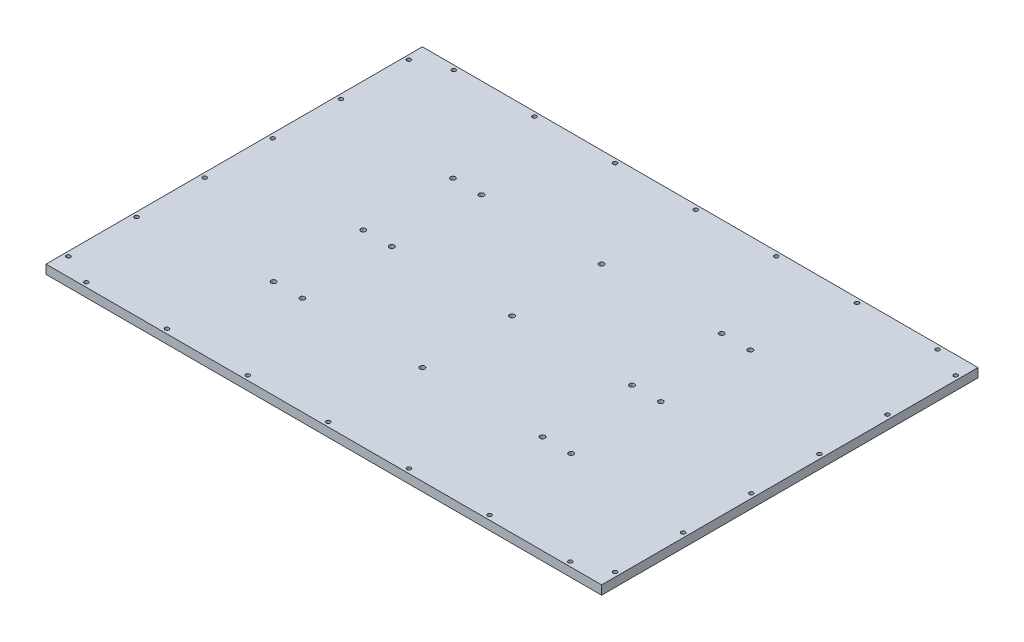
ISO-10303-21;
HEADER;
FILE_DESCRIPTION(('STEP AP214'),'2;1');
FILE_NAME('part.step','',(''),(''),'','','');
FILE_SCHEMA(('AUTOMOTIVE_DESIGN { 1 0 10303 214 1 1 1 1 }'));
ENDSEC;
DATA;
#1=APPLICATION_CONTEXT('core data for automotive mechanical design processes');
#2=APPLICATION_PROTOCOL_DEFINITION('international standard','automotive_design',2000,#1);
#3=PRODUCT_CONTEXT('',#1,'mechanical');
#4=PRODUCT('Part','Part','',(#3));
#5=PRODUCT_RELATED_PRODUCT_CATEGORY('part','',(#4));
#6=PRODUCT_DEFINITION_FORMATION('','',#4);
#7=PRODUCT_DEFINITION_CONTEXT('part definition',#1,'design');
#8=PRODUCT_DEFINITION('design','',#6,#7);
#9=PRODUCT_DEFINITION_SHAPE('','',#8);
#10=(LENGTH_UNIT() NAMED_UNIT(*) SI_UNIT(.MILLI.,.METRE.));
#11=(NAMED_UNIT(*) PLANE_ANGLE_UNIT() SI_UNIT($,.RADIAN.));
#12=(NAMED_UNIT(*) SI_UNIT($,.STERADIAN.) SOLID_ANGLE_UNIT());
#13=UNCERTAINTY_MEASURE_WITH_UNIT(LENGTH_MEASURE(1.E-05),#10,'distance_accuracy_value','');
#14=(GEOMETRIC_REPRESENTATION_CONTEXT(3) GLOBAL_UNCERTAINTY_ASSIGNED_CONTEXT((#13)) GLOBAL_UNIT_ASSIGNED_CONTEXT((#10,
#11,#12)) REPRESENTATION_CONTEXT('',''));
#15=CARTESIAN_POINT('',(0.,0.,0.));
#16=DIRECTION('',(0.,0.,1.));
#17=DIRECTION('',(1.,0.,0.));
#18=AXIS2_PLACEMENT_3D('',#15,#16,#17);
#19=CARTESIAN_POINT('',(0.,10.,0.));
#20=DIRECTION('',(0.,-1.,0.));
#21=DIRECTION('',(0.,0.,-1.));
#22=AXIS2_PLACEMENT_3D('',#19,#20,#21);
#23=PLANE('',#22);
#24=CARTESIAN_POINT('',(-165.999999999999,10.,100.));
#25=DIRECTION('',(0.,1.,0.));
#26=DIRECTION('',(0.,0.,1.));
#27=AXIS2_PLACEMENT_3D('',#24,#25,#26);
#28=CIRCLE('',#27,2.75);
#29=CARTESIAN_POINT('',(-165.999999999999,10.,102.75));
#30=VERTEX_POINT('',#29);
#31=EDGE_CURVE('E673',#30,#30,#28,.T.);
#32=ORIENTED_EDGE('',*,*,#31,.F.);
#33=EDGE_LOOP('',(#32));
#34=FACE_BOUND('',#33,.T.);
#35=CARTESIAN_POINT('',(-165.999999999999,10.,-100.));
#36=DIRECTION('',(0.,1.,0.));
#37=DIRECTION('',(0.,0.,1.));
#38=AXIS2_PLACEMENT_3D('',#35,#36,#37);
#39=CIRCLE('',#38,2.75);
#40=CARTESIAN_POINT('',(-165.999999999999,10.,-97.25));
#41=VERTEX_POINT('',#40);
#42=EDGE_CURVE('E675',#41,#41,#39,.T.);
#43=ORIENTED_EDGE('',*,*,#42,.F.);
#44=EDGE_LOOP('',(#43));
#45=FACE_BOUND('',#44,.T.);
#46=CARTESIAN_POINT('',(-165.999999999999,10.,0.));
#47=DIRECTION('',(0.,1.,0.));
#48=DIRECTION('',(0.,0.,1.));
#49=AXIS2_PLACEMENT_3D('',#46,#47,#48);
#50=CIRCLE('',#49,2.75);
#51=CARTESIAN_POINT('',(-165.999999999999,10.,2.75));
#52=VERTEX_POINT('',#51);
#53=EDGE_CURVE('E683',#52,#52,#50,.T.);
#54=ORIENTED_EDGE('',*,*,#53,.F.);
#55=EDGE_LOOP('',(#54));
#56=FACE_BOUND('',#55,.T.);
#57=CARTESIAN_POINT('',(166.000000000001,10.,100.));
#58=DIRECTION('',(0.,1.,0.));
#59=DIRECTION('',(0.,0.,1.));
#60=AXIS2_PLACEMENT_3D('',#57,#58,#59);
#61=CIRCLE('',#60,2.75);
#62=CARTESIAN_POINT('',(166.000000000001,10.,102.75));
#63=VERTEX_POINT('',#62);
#64=EDGE_CURVE('E695',#63,#63,#61,.T.);
#65=ORIENTED_EDGE('',*,*,#64,.F.);
#66=EDGE_LOOP('',(#65));
#67=FACE_BOUND('',#66,.T.);
#68=CARTESIAN_POINT('',(166.000000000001,10.,-100.));
#69=DIRECTION('',(0.,1.,0.));
#70=DIRECTION('',(0.,0.,1.));
#71=AXIS2_PLACEMENT_3D('',#68,#69,#70);
#72=CIRCLE('',#71,2.75);
#73=CARTESIAN_POINT('',(166.000000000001,10.,-97.25));
#74=VERTEX_POINT('',#73);
#75=EDGE_CURVE('E701',#74,#74,#72,.T.);
#76=ORIENTED_EDGE('',*,*,#75,.F.);
#77=EDGE_LOOP('',(#76));
#78=FACE_BOUND('',#77,.T.);
#79=CARTESIAN_POINT('',(134.000000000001,10.,-100.));
#80=DIRECTION('',(0.,1.,0.));
#81=DIRECTION('',(0.,0.,1.));
#82=AXIS2_PLACEMENT_3D('',#79,#80,#81);
#83=CIRCLE('',#82,2.75);
#84=CARTESIAN_POINT('',(134.000000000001,10.,-97.25));
#85=VERTEX_POINT('',#84);
#86=EDGE_CURVE('E707',#85,#85,#83,.T.);
#87=ORIENTED_EDGE('',*,*,#86,.F.);
#88=EDGE_LOOP('',(#87));
#89=FACE_BOUND('',#88,.T.);
#90=CARTESIAN_POINT('',(-133.999999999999,10.,0.));
#91=DIRECTION('',(0.,1.,0.));
#92=DIRECTION('',(0.,0.,1.));
#93=AXIS2_PLACEMENT_3D('',#90,#91,#92);
#94=CIRCLE('',#93,2.75);
#95=CARTESIAN_POINT('',(-133.999999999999,10.,2.75));
#96=VERTEX_POINT('',#95);
#97=EDGE_CURVE('E713',#96,#96,#94,.T.);
#98=ORIENTED_EDGE('',*,*,#97,.F.);
#99=EDGE_LOOP('',(#98));
#100=FACE_BOUND('',#99,.T.);
#101=CARTESIAN_POINT('',(134.000000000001,10.,0.));
#102=DIRECTION('',(0.,1.,0.));
#103=DIRECTION('',(0.,0.,1.));
#104=AXIS2_PLACEMENT_3D('',#101,#102,#103);
#105=CIRCLE('',#104,2.75);
#106=CARTESIAN_POINT('',(134.000000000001,10.,2.75));
#107=VERTEX_POINT('',#106);
#108=EDGE_CURVE('E719',#107,#107,#105,.T.);
#109=ORIENTED_EDGE('',*,*,#108,.F.);
#110=EDGE_LOOP('',(#109));
#111=FACE_BOUND('',#110,.T.);
#112=CARTESIAN_POINT('',(166.000000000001,10.,0.));
#113=DIRECTION('',(0.,1.,0.));
#114=DIRECTION('',(0.,0.,1.));
#115=AXIS2_PLACEMENT_3D('',#112,#113,#114);
#116=CIRCLE('',#115,2.75);
#117=CARTESIAN_POINT('',(166.000000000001,10.,2.75));
#118=VERTEX_POINT('',#117);
#119=EDGE_CURVE('E725',#118,#118,#116,.T.);
#120=ORIENTED_EDGE('',*,*,#119,.F.);
#121=EDGE_LOOP('',(#120));
#122=FACE_BOUND('',#121,.T.);
#123=CARTESIAN_POINT('',(-133.999999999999,10.,-100.));
#124=DIRECTION('',(0.,1.,0.));
#125=DIRECTION('',(0.,0.,1.));
#126=AXIS2_PLACEMENT_3D('',#123,#124,#125);
#127=CIRCLE('',#126,2.75);
#128=CARTESIAN_POINT('',(-133.999999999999,10.,-97.25));
#129=VERTEX_POINT('',#128);
#130=EDGE_CURVE('E731',#129,#129,#127,.T.);
#131=ORIENTED_EDGE('',*,*,#130,.F.);
#132=EDGE_LOOP('',(#131));
#133=FACE_BOUND('',#132,.T.);
#134=CARTESIAN_POINT('',(-133.999999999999,10.,100.));
#135=DIRECTION('',(0.,1.,0.));
#136=DIRECTION('',(0.,0.,1.));
#137=AXIS2_PLACEMENT_3D('',#134,#135,#136);
#138=CIRCLE('',#137,2.75);
#139=CARTESIAN_POINT('',(-133.999999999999,10.,102.75));
#140=VERTEX_POINT('',#139);
#141=EDGE_CURVE('E737',#140,#140,#138,.T.);
#142=ORIENTED_EDGE('',*,*,#141,.F.);
#143=EDGE_LOOP('',(#142));
#144=FACE_BOUND('',#143,.T.);
#145=CARTESIAN_POINT('',(0.,10.,0.));
#146=DIRECTION('',(0.,1.,0.));
#147=DIRECTION('',(0.,0.,1.));
#148=AXIS2_PLACEMENT_3D('',#145,#146,#147);
#149=CIRCLE('',#148,2.75);
#150=CARTESIAN_POINT('',(0.,10.,2.75));
#151=VERTEX_POINT('',#150);
#152=EDGE_CURVE('E743',#151,#151,#149,.T.);
#153=ORIENTED_EDGE('',*,*,#152,.F.);
#154=EDGE_LOOP('',(#153));
#155=FACE_BOUND('',#154,.T.);
#156=CARTESIAN_POINT('',(0.,10.,99.9999999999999));
#157=DIRECTION('',(0.,1.,0.));
#158=DIRECTION('',(0.,0.,1.));
#159=AXIS2_PLACEMENT_3D('',#156,#157,#158);
#160=CIRCLE('',#159,2.75);
#161=CARTESIAN_POINT('',(0.,10.,102.75));
#162=VERTEX_POINT('',#161);
#163=EDGE_CURVE('E749',#162,#162,#160,.T.);
#164=ORIENTED_EDGE('',*,*,#163,.F.);
#165=EDGE_LOOP('',(#164));
#166=FACE_BOUND('',#165,.T.);
#167=CARTESIAN_POINT('',(0.,10.,-100.));
#168=DIRECTION('',(0.,1.,0.));
#169=DIRECTION('',(0.,0.,1.));
#170=AXIS2_PLACEMENT_3D('',#167,#168,#169);
#171=CIRCLE('',#170,2.75);
#172=CARTESIAN_POINT('',(0.,10.,-97.2500000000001));
#173=VERTEX_POINT('',#172);
#174=EDGE_CURVE('E755',#173,#173,#171,.T.);
#175=ORIENTED_EDGE('',*,*,#174,.F.);
#176=EDGE_LOOP('',(#175));
#177=FACE_BOUND('',#176,.T.);
#178=CARTESIAN_POINT('',(305.,9.99999999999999,189.999999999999));
#179=DIRECTION('',(0.,-1.,0.));
#180=DIRECTION('',(0.,0.,-1.));
#181=AXIS2_PLACEMENT_3D('',#178,#179,#180);
#182=CIRCLE('',#181,2.24999999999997);
#183=CARTESIAN_POINT('',(305.,9.99999999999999,187.749999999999));
#184=VERTEX_POINT('',#183);
#185=EDGE_CURVE('E219',#184,#184,#182,.T.);
#186=ORIENTED_EDGE('',*,*,#185,.T.);
#187=EDGE_LOOP('',(#186));
#188=FACE_BOUND('',#187,.T.);
#189=CARTESIAN_POINT('',(305.,9.99999999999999,113.999999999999));
#190=DIRECTION('',(0.,-1.,0.));
#191=DIRECTION('',(0.,0.,-1.));
#192=AXIS2_PLACEMENT_3D('',#189,#190,#191);
#193=CIRCLE('',#192,2.24999999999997);
#194=CARTESIAN_POINT('',(305.,9.99999999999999,111.749999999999));
#195=VERTEX_POINT('',#194);
#196=EDGE_CURVE('E209',#195,#195,#193,.T.);
#197=ORIENTED_EDGE('',*,*,#196,.T.);
#198=EDGE_LOOP('',(#197));
#199=FACE_BOUND('',#198,.T.);
#200=CARTESIAN_POINT('',(305.,9.99999999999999,37.999999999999));
#201=DIRECTION('',(0.,-1.,0.));
#202=DIRECTION('',(0.,0.,-1.));
#203=AXIS2_PLACEMENT_3D('',#200,#201,#202);
#204=CIRCLE('',#203,2.24999999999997);
#205=CARTESIAN_POINT('',(305.,9.99999999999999,35.7499999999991));
#206=VERTEX_POINT('',#205);
#207=EDGE_CURVE('E206',#206,#206,#204,.T.);
#208=ORIENTED_EDGE('',*,*,#207,.T.);
#209=EDGE_LOOP('',(#208));
#210=FACE_BOUND('',#209,.T.);
#211=CARTESIAN_POINT('',(305.,9.99999999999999,-38.0000000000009));
#212=DIRECTION('',(0.,-1.,0.));
#213=DIRECTION('',(0.,0.,-1.));
#214=AXIS2_PLACEMENT_3D('',#211,#212,#213);
#215=CIRCLE('',#214,2.24999999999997);
#216=CARTESIAN_POINT('',(305.,9.99999999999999,-40.2500000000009));
#217=VERTEX_POINT('',#216);
#218=EDGE_CURVE('E203',#217,#217,#215,.T.);
#219=ORIENTED_EDGE('',*,*,#218,.T.);
#220=EDGE_LOOP('',(#219));
#221=FACE_BOUND('',#220,.T.);
#222=CARTESIAN_POINT('',(180.,9.99999999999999,205.));
#223=DIRECTION('',(0.,-1.,0.));
#224=DIRECTION('',(0.,0.,-1.));
#225=AXIS2_PLACEMENT_3D('',#222,#223,#224);
#226=CIRCLE('',#225,2.25);
#227=CARTESIAN_POINT('',(180.,9.99999999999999,202.75));
#228=VERTEX_POINT('',#227);
#229=EDGE_CURVE('E199',#228,#228,#226,.T.);
#230=ORIENTED_EDGE('',*,*,#229,.T.);
#231=EDGE_LOOP('',(#230));
#232=FACE_BOUND('',#231,.T.);
#233=CARTESIAN_POINT('',(90.,9.99999999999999,205.));
#234=DIRECTION('',(0.,-1.,0.));
#235=DIRECTION('',(0.,0.,-1.));
#236=AXIS2_PLACEMENT_3D('',#233,#234,#235);
#237=CIRCLE('',#236,2.25);
#238=CARTESIAN_POINT('',(90.,9.99999999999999,202.75));
#239=VERTEX_POINT('',#238);
#240=EDGE_CURVE('E195',#239,#239,#237,.T.);
#241=ORIENTED_EDGE('',*,*,#240,.T.);
#242=EDGE_LOOP('',(#241));
#243=FACE_BOUND('',#242,.T.);
#244=CARTESIAN_POINT('',(0.,9.99999999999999,205.));
#245=DIRECTION('',(0.,-1.,0.));
#246=DIRECTION('',(0.,0.,-1.));
#247=AXIS2_PLACEMENT_3D('',#244,#245,#246);
#248=CIRCLE('',#247,2.25);
#249=CARTESIAN_POINT('',(0.,9.99999999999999,202.75));
#250=VERTEX_POINT('',#249);
#251=EDGE_CURVE('E191',#250,#250,#248,.T.);
#252=ORIENTED_EDGE('',*,*,#251,.T.);
#253=EDGE_LOOP('',(#252));
#254=FACE_BOUND('',#253,.T.);
#255=CARTESIAN_POINT('',(-90.,9.99999999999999,205.));
#256=DIRECTION('',(0.,-1.,0.));
#257=DIRECTION('',(0.,0.,-1.));
#258=AXIS2_PLACEMENT_3D('',#255,#256,#257);
#259=CIRCLE('',#258,2.25);
#260=CARTESIAN_POINT('',(-90.,9.99999999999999,202.75));
#261=VERTEX_POINT('',#260);
#262=EDGE_CURVE('E187',#261,#261,#259,.T.);
#263=ORIENTED_EDGE('',*,*,#262,.T.);
#264=EDGE_LOOP('',(#263));
#265=FACE_BOUND('',#264,.T.);
#266=CARTESIAN_POINT('',(270.,9.99999999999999,205.));
#267=DIRECTION('',(0.,-1.,0.));
#268=DIRECTION('',(0.,0.,-1.));
#269=AXIS2_PLACEMENT_3D('',#266,#267,#268);
#270=CIRCLE('',#269,2.24999999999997);
#271=CARTESIAN_POINT('',(270.,9.99999999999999,202.75));
#272=VERTEX_POINT('',#271);
#273=EDGE_CURVE('E183',#272,#272,#270,.T.);
#274=ORIENTED_EDGE('',*,*,#273,.T.);
#275=EDGE_LOOP('',(#274));
#276=FACE_BOUND('',#275,.T.);
#277=CARTESIAN_POINT('',(-180.,9.99999999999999,205.));
#278=DIRECTION('',(0.,-1.,0.));
#279=DIRECTION('',(0.,0.,-1.));
#280=AXIS2_PLACEMENT_3D('',#277,#278,#279);
#281=CIRCLE('',#280,2.25);
#282=CARTESIAN_POINT('',(-180.,9.99999999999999,202.75));
#283=VERTEX_POINT('',#282);
#284=EDGE_CURVE('E179',#283,#283,#281,.T.);
#285=ORIENTED_EDGE('',*,*,#284,.T.);
#286=EDGE_LOOP('',(#285));
#287=FACE_BOUND('',#286,.T.);
#288=CARTESIAN_POINT('',(-270.,9.99999999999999,205.));
#289=DIRECTION('',(0.,-1.,0.));
#290=DIRECTION('',(0.,0.,-1.));
#291=AXIS2_PLACEMENT_3D('',#288,#289,#290);
#292=CIRCLE('',#291,2.24999999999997);
#293=CARTESIAN_POINT('',(-270.,9.99999999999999,202.75));
#294=VERTEX_POINT('',#293);
#295=EDGE_CURVE('E175',#294,#294,#292,.T.);
#296=ORIENTED_EDGE('',*,*,#295,.T.);
#297=EDGE_LOOP('',(#296));
#298=FACE_BOUND('',#297,.T.);
#299=CARTESIAN_POINT('',(-305.,9.99999999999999,189.999999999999));
#300=DIRECTION('',(0.,-1.,0.));
#301=DIRECTION('',(0.,0.,-1.));
#302=AXIS2_PLACEMENT_3D('',#299,#300,#301);
#303=CIRCLE('',#302,2.24999999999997);
#304=CARTESIAN_POINT('',(-305.,9.99999999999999,187.749999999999));
#305=VERTEX_POINT('',#304);
#306=EDGE_CURVE('E171',#305,#305,#303,.T.);
#307=ORIENTED_EDGE('',*,*,#306,.T.);
#308=EDGE_LOOP('',(#307));
#309=FACE_BOUND('',#308,.T.);
#310=CARTESIAN_POINT('',(-305.,9.99999999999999,113.999999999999));
#311=DIRECTION('',(0.,-1.,0.));
#312=DIRECTION('',(0.,0.,-1.));
#313=AXIS2_PLACEMENT_3D('',#310,#311,#312);
#314=CIRCLE('',#313,2.24999999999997);
#315=CARTESIAN_POINT('',(-305.,9.99999999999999,111.749999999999));
#316=VERTEX_POINT('',#315);
#317=EDGE_CURVE('E167',#316,#316,#314,.T.);
#318=ORIENTED_EDGE('',*,*,#317,.T.);
#319=EDGE_LOOP('',(#318));
#320=FACE_BOUND('',#319,.T.);
#321=CARTESIAN_POINT('',(-305.,9.99999999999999,37.999999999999));
#322=DIRECTION('',(0.,-1.,0.));
#323=DIRECTION('',(0.,0.,-1.));
#324=AXIS2_PLACEMENT_3D('',#321,#322,#323);
#325=CIRCLE('',#324,2.24999999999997);
#326=CARTESIAN_POINT('',(-305.,9.99999999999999,35.7499999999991));
#327=VERTEX_POINT('',#326);
#328=EDGE_CURVE('E163',#327,#327,#325,.T.);
#329=ORIENTED_EDGE('',*,*,#328,.T.);
#330=EDGE_LOOP('',(#329));
#331=FACE_BOUND('',#330,.T.);
#332=CARTESIAN_POINT('',(-305.,9.99999999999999,-38.0000000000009));
#333=DIRECTION('',(0.,-1.,0.));
#334=DIRECTION('',(0.,0.,-1.));
#335=AXIS2_PLACEMENT_3D('',#332,#333,#334);
#336=CIRCLE('',#335,2.24999999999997);
#337=CARTESIAN_POINT('',(-305.,9.99999999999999,-40.2500000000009));
#338=VERTEX_POINT('',#337);
#339=EDGE_CURVE('E159',#338,#338,#336,.T.);
#340=ORIENTED_EDGE('',*,*,#339,.T.);
#341=EDGE_LOOP('',(#340));
#342=FACE_BOUND('',#341,.T.);
#343=CARTESIAN_POINT('',(-305.,9.99999999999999,-114.000000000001));
#344=DIRECTION('',(0.,-1.,0.));
#345=DIRECTION('',(0.,0.,-1.));
#346=AXIS2_PLACEMENT_3D('',#343,#344,#345);
#347=CIRCLE('',#346,2.24999999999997);
#348=CARTESIAN_POINT('',(-305.,9.99999999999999,-116.250000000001));
#349=VERTEX_POINT('',#348);
#350=EDGE_CURVE('E155',#349,#349,#347,.T.);
#351=ORIENTED_EDGE('',*,*,#350,.T.);
#352=EDGE_LOOP('',(#351));
#353=FACE_BOUND('',#352,.T.);
#354=CARTESIAN_POINT('',(-305.,9.99999999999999,-190.000000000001));
#355=DIRECTION('',(0.,-1.,0.));
#356=DIRECTION('',(0.,0.,-1.));
#357=AXIS2_PLACEMENT_3D('',#354,#355,#356);
#358=CIRCLE('',#357,2.24999999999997);
#359=CARTESIAN_POINT('',(-305.,9.99999999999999,-192.250000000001));
#360=VERTEX_POINT('',#359);
#361=EDGE_CURVE('E151',#360,#360,#358,.T.);
#362=ORIENTED_EDGE('',*,*,#361,.T.);
#363=EDGE_LOOP('',(#362));
#364=FACE_BOUND('',#363,.T.);
#365=CARTESIAN_POINT('',(-270.,9.99999999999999,-205.));
#366=DIRECTION('',(0.,-1.,0.));
#367=DIRECTION('',(0.,0.,-1.));
#368=AXIS2_PLACEMENT_3D('',#365,#366,#367);
#369=CIRCLE('',#368,2.24999999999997);
#370=CARTESIAN_POINT('',(-270.,9.99999999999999,-207.25));
#371=VERTEX_POINT('',#370);
#372=EDGE_CURVE('E147',#371,#371,#369,.T.);
#373=ORIENTED_EDGE('',*,*,#372,.T.);
#374=EDGE_LOOP('',(#373));
#375=FACE_BOUND('',#374,.T.);
#376=CARTESIAN_POINT('',(-180.,9.99999999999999,-205.));
#377=DIRECTION('',(0.,-1.,0.));
#378=DIRECTION('',(0.,0.,-1.));
#379=AXIS2_PLACEMENT_3D('',#376,#377,#378);
#380=CIRCLE('',#379,2.25);
#381=CARTESIAN_POINT('',(-180.,9.99999999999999,-207.25));
#382=VERTEX_POINT('',#381);
#383=EDGE_CURVE('E143',#382,#382,#380,.T.);
#384=ORIENTED_EDGE('',*,*,#383,.T.);
#385=EDGE_LOOP('',(#384));
#386=FACE_BOUND('',#385,.T.);
#387=CARTESIAN_POINT('',(-90.,9.99999999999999,-205.));
#388=DIRECTION('',(0.,-1.,0.));
#389=DIRECTION('',(0.,0.,-1.));
#390=AXIS2_PLACEMENT_3D('',#387,#388,#389);
#391=CIRCLE('',#390,2.25);
#392=CARTESIAN_POINT('',(-90.,9.99999999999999,-207.25));
#393=VERTEX_POINT('',#392);
#394=EDGE_CURVE('E139',#393,#393,#391,.T.);
#395=ORIENTED_EDGE('',*,*,#394,.T.);
#396=EDGE_LOOP('',(#395));
#397=FACE_BOUND('',#396,.T.);
#398=CARTESIAN_POINT('',(0.,9.99999999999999,-205.));
#399=DIRECTION('',(0.,-1.,0.));
#400=DIRECTION('',(0.,0.,-1.));
#401=AXIS2_PLACEMENT_3D('',#398,#399,#400);
#402=CIRCLE('',#401,2.25);
#403=CARTESIAN_POINT('',(0.,9.99999999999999,-207.25));
#404=VERTEX_POINT('',#403);
#405=EDGE_CURVE('E135',#404,#404,#402,.T.);
#406=ORIENTED_EDGE('',*,*,#405,.T.);
#407=EDGE_LOOP('',(#406));
#408=FACE_BOUND('',#407,.T.);
#409=CARTESIAN_POINT('',(90.,9.99999999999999,-205.));
#410=DIRECTION('',(0.,-1.,0.));
#411=DIRECTION('',(0.,0.,-1.));
#412=AXIS2_PLACEMENT_3D('',#409,#410,#411);
#413=CIRCLE('',#412,2.25);
#414=CARTESIAN_POINT('',(90.,9.99999999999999,-207.25));
#415=VERTEX_POINT('',#414);
#416=EDGE_CURVE('E131',#415,#415,#413,.T.);
#417=ORIENTED_EDGE('',*,*,#416,.T.);
#418=EDGE_LOOP('',(#417));
#419=FACE_BOUND('',#418,.T.);
#420=CARTESIAN_POINT('',(180.,9.99999999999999,-205.));
#421=DIRECTION('',(0.,-1.,0.));
#422=DIRECTION('',(0.,0.,-1.));
#423=AXIS2_PLACEMENT_3D('',#420,#421,#422);
#424=CIRCLE('',#423,2.25);
#425=CARTESIAN_POINT('',(180.,9.99999999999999,-207.25));
#426=VERTEX_POINT('',#425);
#427=EDGE_CURVE('E127',#426,#426,#424,.T.);
#428=ORIENTED_EDGE('',*,*,#427,.T.);
#429=EDGE_LOOP('',(#428));
#430=FACE_BOUND('',#429,.T.);
#431=CARTESIAN_POINT('',(270.,9.99999999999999,-205.));
#432=DIRECTION('',(0.,-1.,0.));
#433=DIRECTION('',(0.,0.,-1.));
#434=AXIS2_PLACEMENT_3D('',#431,#432,#433);
#435=CIRCLE('',#434,2.24999999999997);
#436=CARTESIAN_POINT('',(270.,9.99999999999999,-207.25));
#437=VERTEX_POINT('',#436);
#438=EDGE_CURVE('E123',#437,#437,#435,.T.);
#439=ORIENTED_EDGE('',*,*,#438,.T.);
#440=EDGE_LOOP('',(#439));
#441=FACE_BOUND('',#440,.T.);
#442=CARTESIAN_POINT('',(305.,9.99999999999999,-190.000000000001));
#443=DIRECTION('',(0.,-1.,0.));
#444=DIRECTION('',(0.,0.,-1.));
#445=AXIS2_PLACEMENT_3D('',#442,#443,#444);
#446=CIRCLE('',#445,2.24999999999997);
#447=CARTESIAN_POINT('',(305.,9.99999999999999,-192.250000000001));
#448=VERTEX_POINT('',#447);
#449=EDGE_CURVE('E119',#448,#448,#446,.T.);
#450=ORIENTED_EDGE('',*,*,#449,.T.);
#451=EDGE_LOOP('',(#450));
#452=FACE_BOUND('',#451,.T.);
#453=CARTESIAN_POINT('',(305.,9.99999999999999,-114.000000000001));
#454=DIRECTION('',(0.,-1.,0.));
#455=DIRECTION('',(0.,0.,-1.));
#456=AXIS2_PLACEMENT_3D('',#453,#454,#455);
#457=CIRCLE('',#456,2.24999999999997);
#458=CARTESIAN_POINT('',(305.,9.99999999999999,-116.250000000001));
#459=VERTEX_POINT('',#458);
#460=EDGE_CURVE('E115',#459,#459,#457,.T.);
#461=ORIENTED_EDGE('',*,*,#460,.T.);
#462=EDGE_LOOP('',(#461));
#463=FACE_BOUND('',#462,.T.);
#464=DIRECTION('',(0.,0.,1.));
#465=VECTOR('',#464,1.);
#466=CARTESIAN_POINT('',(-310.,10.,-210.));
#467=LINE('',#466,#465);
#468=CARTESIAN_POINT('',(-310.,10.,-210.));
#469=VERTEX_POINT('',#468);
#470=CARTESIAN_POINT('',(-310.,10.,210.));
#471=VERTEX_POINT('',#470);
#472=EDGE_CURVE('E91',#469,#471,#467,.T.);
#473=ORIENTED_EDGE('',*,*,#472,.T.);
#474=DIRECTION('',(1.,0.,0.));
#475=VECTOR('',#474,1.);
#476=CARTESIAN_POINT('',(310.,10.,210.));
#477=LINE('',#476,#475);
#478=CARTESIAN_POINT('',(310.,10.,210.));
#479=VERTEX_POINT('',#478);
#480=EDGE_CURVE('E86',#471,#479,#477,.T.);
#481=ORIENTED_EDGE('',*,*,#480,.T.);
#482=DIRECTION('',(0.,0.,-1.));
#483=VECTOR('',#482,1.);
#484=CARTESIAN_POINT('',(310.,10.,-210.));
#485=LINE('',#484,#483);
#486=CARTESIAN_POINT('',(310.,10.,-210.));
#487=VERTEX_POINT('',#486);
#488=EDGE_CURVE('E89',#479,#487,#485,.T.);
#489=ORIENTED_EDGE('',*,*,#488,.T.);
#490=DIRECTION('',(-1.,0.,0.));
#491=VECTOR('',#490,1.);
#492=CARTESIAN_POINT('',(310.,10.,-210.));
#493=LINE('',#492,#491);
#494=EDGE_CURVE('E56',#487,#469,#493,.T.);
#495=ORIENTED_EDGE('',*,*,#494,.T.);
#496=EDGE_LOOP('',(#473,#481,#489,#495));
#497=FACE_BOUND('',#496,.T.);
#498=CARTESIAN_POINT('',(134.000000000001,10.,100.));
#499=DIRECTION('',(0.,1.,0.));
#500=DIRECTION('',(0.,0.,1.));
#501=AXIS2_PLACEMENT_3D('',#498,#499,#500);
#502=CIRCLE('',#501,2.75);
#503=CARTESIAN_POINT('',(134.000000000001,10.,102.75));
#504=VERTEX_POINT('',#503);
#505=EDGE_CURVE('E689',#504,#504,#502,.T.);
#506=ORIENTED_EDGE('',*,*,#505,.F.);
#507=EDGE_LOOP('',(#506));
#508=FACE_BOUND('',#507,.T.);
#509=ADVANCED_FACE('F37',(#34,#45,#56,#67,#78,#89,#100,#111,#122,#133,#144,#155,#166,#177,#188,
#199,#210,#221,#232,#243,#254,#265,#276,#287,#298,#309,#320,#331,#342,#353,#364,#375,#386,#397,
#408,#419,#430,#441,#452,#463,#497,#508),#23,.F.);
#510=CARTESIAN_POINT('',(-310.,10.,-210.));
#511=DIRECTION('',(1.,0.,0.));
#512=DIRECTION('',(0.,0.,-1.));
#513=AXIS2_PLACEMENT_3D('',#510,#511,#512);
#514=PLANE('',#513);
#515=DIRECTION('',(0.,0.,1.));
#516=VECTOR('',#515,1.);
#517=CARTESIAN_POINT('',(-310.,0.,-210.));
#518=LINE('',#517,#516);
#519=CARTESIAN_POINT('',(-310.,0.,-210.));
#520=VERTEX_POINT('',#519);
#521=CARTESIAN_POINT('',(-310.,0.,210.));
#522=VERTEX_POINT('',#521);
#523=EDGE_CURVE('E104',#520,#522,#518,.T.);
#524=ORIENTED_EDGE('',*,*,#523,.T.);
#525=DIRECTION('',(0.,-1.,0.));
#526=VECTOR('',#525,1.);
#527=CARTESIAN_POINT('',(-310.,10.,210.));
#528=LINE('',#527,#526);
#529=EDGE_CURVE('E11',#471,#522,#528,.T.);
#530=ORIENTED_EDGE('',*,*,#529,.F.);
#531=ORIENTED_EDGE('',*,*,#472,.F.);
#532=DIRECTION('',(0.,-1.,0.));
#533=VECTOR('',#532,1.);
#534=CARTESIAN_POINT('',(-310.,10.,-210.));
#535=LINE('',#534,#533);
#536=EDGE_CURVE('E100',#469,#520,#535,.T.);
#537=ORIENTED_EDGE('',*,*,#536,.T.);
#538=EDGE_LOOP('',(#524,#530,#531,#537));
#539=FACE_BOUND('',#538,.T.);
#540=ADVANCED_FACE('F39',(#539),#514,.F.);
#541=CARTESIAN_POINT('',(310.,10.,210.));
#542=DIRECTION('',(0.,0.,-1.));
#543=DIRECTION('',(-1.,0.,0.));
#544=AXIS2_PLACEMENT_3D('',#541,#542,#543);
#545=PLANE('',#544);
#546=DIRECTION('',(1.,0.,0.));
#547=VECTOR('',#546,1.);
#548=CARTESIAN_POINT('',(310.,0.,210.));
#549=LINE('',#548,#547);
#550=CARTESIAN_POINT('',(310.,0.,210.));
#551=VERTEX_POINT('',#550);
#552=EDGE_CURVE('E95',#522,#551,#549,.T.);
#553=ORIENTED_EDGE('',*,*,#552,.T.);
#554=DIRECTION('',(0.,-1.,0.));
#555=VECTOR('',#554,1.);
#556=CARTESIAN_POINT('',(310.,10.,210.));
#557=LINE('',#556,#555);
#558=EDGE_CURVE('E47',#479,#551,#557,.T.);
#559=ORIENTED_EDGE('',*,*,#558,.F.);
#560=ORIENTED_EDGE('',*,*,#480,.F.);
#561=ORIENTED_EDGE('',*,*,#529,.T.);
#562=EDGE_LOOP('',(#553,#559,#560,#561));
#563=FACE_BOUND('',#562,.T.);
#564=ADVANCED_FACE('F94',(#563),#545,.F.);
#565=CARTESIAN_POINT('',(310.,10.,-210.));
#566=DIRECTION('',(-1.,0.,0.));
#567=DIRECTION('',(0.,0.,1.));
#568=AXIS2_PLACEMENT_3D('',#565,#566,#567);
#569=PLANE('',#568);
#570=DIRECTION('',(0.,0.,-1.));
#571=VECTOR('',#570,1.);
#572=CARTESIAN_POINT('',(310.,0.,-210.));
#573=LINE('',#572,#571);
#574=CARTESIAN_POINT('',(310.,0.,-210.));
#575=VERTEX_POINT('',#574);
#576=EDGE_CURVE('E73',#551,#575,#573,.T.);
#577=ORIENTED_EDGE('',*,*,#576,.T.);
#578=DIRECTION('',(0.,-1.,0.));
#579=VECTOR('',#578,1.);
#580=CARTESIAN_POINT('',(310.,10.,-210.));
#581=LINE('',#580,#579);
#582=EDGE_CURVE('E96',#487,#575,#581,.T.);
#583=ORIENTED_EDGE('',*,*,#582,.F.);
#584=ORIENTED_EDGE('',*,*,#488,.F.);
#585=ORIENTED_EDGE('',*,*,#558,.T.);
#586=EDGE_LOOP('',(#577,#583,#584,#585));
#587=FACE_BOUND('',#586,.T.);
#588=ADVANCED_FACE('F98',(#587),#569,.F.);
#589=CARTESIAN_POINT('',(310.,10.,-210.));
#590=DIRECTION('',(0.,0.,1.));
#591=DIRECTION('',(1.,0.,0.));
#592=AXIS2_PLACEMENT_3D('',#589,#590,#591);
#593=PLANE('',#592);
#594=DIRECTION('',(-1.,0.,0.));
#595=VECTOR('',#594,1.);
#596=CARTESIAN_POINT('',(310.,0.,-210.));
#597=LINE('',#596,#595);
#598=EDGE_CURVE('E79',#575,#520,#597,.T.);
#599=ORIENTED_EDGE('',*,*,#598,.T.);
#600=ORIENTED_EDGE('',*,*,#536,.F.);
#601=ORIENTED_EDGE('',*,*,#494,.F.);
#602=ORIENTED_EDGE('',*,*,#582,.T.);
#603=EDGE_LOOP('',(#599,#600,#601,#602));
#604=FACE_BOUND('',#603,.T.);
#605=ADVANCED_FACE('F284',(#604),#593,.F.);
#606=CARTESIAN_POINT('',(0.,0.,0.));
#607=DIRECTION('',(0.,-1.,0.));
#608=DIRECTION('',(0.,0.,-1.));
#609=AXIS2_PLACEMENT_3D('',#606,#607,#608);
#610=PLANE('',#609);
#611=CARTESIAN_POINT('',(-165.999999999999,0.,100.));
#612=DIRECTION('',(0.,1.,0.));
#613=DIRECTION('',(0.,0.,1.));
#614=AXIS2_PLACEMENT_3D('',#611,#612,#613);
#615=CIRCLE('',#614,2.75);
#616=CARTESIAN_POINT('',(-165.999999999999,0.,102.75));
#617=VERTEX_POINT('',#616);
#618=EDGE_CURVE('E671',#617,#617,#615,.T.);
#619=ORIENTED_EDGE('',*,*,#618,.T.);
#620=EDGE_LOOP('',(#619));
#621=FACE_BOUND('',#620,.T.);
#622=CARTESIAN_POINT('',(-165.999999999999,0.,-100.));
#623=DIRECTION('',(0.,1.,0.));
#624=DIRECTION('',(0.,0.,1.));
#625=AXIS2_PLACEMENT_3D('',#622,#623,#624);
#626=CIRCLE('',#625,2.75);
#627=CARTESIAN_POINT('',(-165.999999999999,0.,-97.25));
#628=VERTEX_POINT('',#627);
#629=EDGE_CURVE('E680',#628,#628,#626,.T.);
#630=ORIENTED_EDGE('',*,*,#629,.T.);
#631=EDGE_LOOP('',(#630));
#632=FACE_BOUND('',#631,.T.);
#633=CARTESIAN_POINT('',(-165.999999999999,0.,0.));
#634=DIRECTION('',(0.,1.,0.));
#635=DIRECTION('',(0.,0.,1.));
#636=AXIS2_PLACEMENT_3D('',#633,#634,#635);
#637=CIRCLE('',#636,2.75);
#638=CARTESIAN_POINT('',(-165.999999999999,0.,2.75));
#639=VERTEX_POINT('',#638);
#640=EDGE_CURVE('E686',#639,#639,#637,.T.);
#641=ORIENTED_EDGE('',*,*,#640,.T.);
#642=EDGE_LOOP('',(#641));
#643=FACE_BOUND('',#642,.T.);
#644=CARTESIAN_POINT('',(134.000000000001,0.,100.));
#645=DIRECTION('',(0.,1.,0.));
#646=DIRECTION('',(0.,0.,1.));
#647=AXIS2_PLACEMENT_3D('',#644,#645,#646);
#648=CIRCLE('',#647,2.75);
#649=CARTESIAN_POINT('',(134.000000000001,0.,102.75));
#650=VERTEX_POINT('',#649);
#651=EDGE_CURVE('E692',#650,#650,#648,.T.);
#652=ORIENTED_EDGE('',*,*,#651,.T.);
#653=EDGE_LOOP('',(#652));
#654=FACE_BOUND('',#653,.T.);
#655=CARTESIAN_POINT('',(166.000000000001,0.,100.));
#656=DIRECTION('',(0.,1.,0.));
#657=DIRECTION('',(0.,0.,1.));
#658=AXIS2_PLACEMENT_3D('',#655,#656,#657);
#659=CIRCLE('',#658,2.75);
#660=CARTESIAN_POINT('',(166.000000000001,0.,102.75));
#661=VERTEX_POINT('',#660);
#662=EDGE_CURVE('E698',#661,#661,#659,.T.);
#663=ORIENTED_EDGE('',*,*,#662,.T.);
#664=EDGE_LOOP('',(#663));
#665=FACE_BOUND('',#664,.T.);
#666=CARTESIAN_POINT('',(166.000000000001,0.,-100.));
#667=DIRECTION('',(0.,1.,0.));
#668=DIRECTION('',(0.,0.,1.));
#669=AXIS2_PLACEMENT_3D('',#666,#667,#668);
#670=CIRCLE('',#669,2.75);
#671=CARTESIAN_POINT('',(166.000000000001,0.,-97.25));
#672=VERTEX_POINT('',#671);
#673=EDGE_CURVE('E704',#672,#672,#670,.T.);
#674=ORIENTED_EDGE('',*,*,#673,.T.);
#675=EDGE_LOOP('',(#674));
#676=FACE_BOUND('',#675,.T.);
#677=CARTESIAN_POINT('',(134.000000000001,0.,-100.));
#678=DIRECTION('',(0.,1.,0.));
#679=DIRECTION('',(0.,0.,1.));
#680=AXIS2_PLACEMENT_3D('',#677,#678,#679);
#681=CIRCLE('',#680,2.75);
#682=CARTESIAN_POINT('',(134.000000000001,0.,-97.25));
#683=VERTEX_POINT('',#682);
#684=EDGE_CURVE('E710',#683,#683,#681,.T.);
#685=ORIENTED_EDGE('',*,*,#684,.T.);
#686=EDGE_LOOP('',(#685));
#687=FACE_BOUND('',#686,.T.);
#688=CARTESIAN_POINT('',(-133.999999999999,0.,0.));
#689=DIRECTION('',(0.,1.,0.));
#690=DIRECTION('',(0.,0.,1.));
#691=AXIS2_PLACEMENT_3D('',#688,#689,#690);
#692=CIRCLE('',#691,2.75);
#693=CARTESIAN_POINT('',(-133.999999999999,0.,2.75));
#694=VERTEX_POINT('',#693);
#695=EDGE_CURVE('E716',#694,#694,#692,.T.);
#696=ORIENTED_EDGE('',*,*,#695,.T.);
#697=EDGE_LOOP('',(#696));
#698=FACE_BOUND('',#697,.T.);
#699=CARTESIAN_POINT('',(134.000000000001,0.,0.));
#700=DIRECTION('',(0.,1.,0.));
#701=DIRECTION('',(0.,0.,1.));
#702=AXIS2_PLACEMENT_3D('',#699,#700,#701);
#703=CIRCLE('',#702,2.75);
#704=CARTESIAN_POINT('',(134.000000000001,0.,2.75));
#705=VERTEX_POINT('',#704);
#706=EDGE_CURVE('E722',#705,#705,#703,.T.);
#707=ORIENTED_EDGE('',*,*,#706,.T.);
#708=EDGE_LOOP('',(#707));
#709=FACE_BOUND('',#708,.T.);
#710=CARTESIAN_POINT('',(166.000000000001,0.,0.));
#711=DIRECTION('',(0.,1.,0.));
#712=DIRECTION('',(0.,0.,1.));
#713=AXIS2_PLACEMENT_3D('',#710,#711,#712);
#714=CIRCLE('',#713,2.75);
#715=CARTESIAN_POINT('',(166.000000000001,0.,2.75));
#716=VERTEX_POINT('',#715);
#717=EDGE_CURVE('E728',#716,#716,#714,.T.);
#718=ORIENTED_EDGE('',*,*,#717,.T.);
#719=EDGE_LOOP('',(#718));
#720=FACE_BOUND('',#719,.T.);
#721=CARTESIAN_POINT('',(-133.999999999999,0.,-100.));
#722=DIRECTION('',(0.,1.,0.));
#723=DIRECTION('',(0.,0.,1.));
#724=AXIS2_PLACEMENT_3D('',#721,#722,#723);
#725=CIRCLE('',#724,2.75);
#726=CARTESIAN_POINT('',(-133.999999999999,0.,-97.25));
#727=VERTEX_POINT('',#726);
#728=EDGE_CURVE('E734',#727,#727,#725,.T.);
#729=ORIENTED_EDGE('',*,*,#728,.T.);
#730=EDGE_LOOP('',(#729));
#731=FACE_BOUND('',#730,.T.);
#732=CARTESIAN_POINT('',(-133.999999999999,0.,100.));
#733=DIRECTION('',(0.,1.,0.));
#734=DIRECTION('',(0.,0.,1.));
#735=AXIS2_PLACEMENT_3D('',#732,#733,#734);
#736=CIRCLE('',#735,2.75);
#737=CARTESIAN_POINT('',(-133.999999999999,0.,102.75));
#738=VERTEX_POINT('',#737);
#739=EDGE_CURVE('E740',#738,#738,#736,.T.);
#740=ORIENTED_EDGE('',*,*,#739,.T.);
#741=EDGE_LOOP('',(#740));
#742=FACE_BOUND('',#741,.T.);
#743=CARTESIAN_POINT('',(0.,0.,0.));
#744=DIRECTION('',(0.,1.,0.));
#745=DIRECTION('',(0.,0.,1.));
#746=AXIS2_PLACEMENT_3D('',#743,#744,#745);
#747=CIRCLE('',#746,2.75);
#748=CARTESIAN_POINT('',(0.,0.,2.75));
#749=VERTEX_POINT('',#748);
#750=EDGE_CURVE('E746',#749,#749,#747,.T.);
#751=ORIENTED_EDGE('',*,*,#750,.T.);
#752=EDGE_LOOP('',(#751));
#753=FACE_BOUND('',#752,.T.);
#754=CARTESIAN_POINT('',(0.,0.,99.9999999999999));
#755=DIRECTION('',(0.,1.,0.));
#756=DIRECTION('',(0.,0.,1.));
#757=AXIS2_PLACEMENT_3D('',#754,#755,#756);
#758=CIRCLE('',#757,2.75);
#759=CARTESIAN_POINT('',(0.,0.,102.75));
#760=VERTEX_POINT('',#759);
#761=EDGE_CURVE('E752',#760,#760,#758,.T.);
#762=ORIENTED_EDGE('',*,*,#761,.T.);
#763=EDGE_LOOP('',(#762));
#764=FACE_BOUND('',#763,.T.);
#765=CARTESIAN_POINT('',(0.,0.,-100.));
#766=DIRECTION('',(0.,1.,0.));
#767=DIRECTION('',(0.,0.,1.));
#768=AXIS2_PLACEMENT_3D('',#765,#766,#767);
#769=CIRCLE('',#768,2.75);
#770=CARTESIAN_POINT('',(0.,0.,-97.2500000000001));
#771=VERTEX_POINT('',#770);
#772=EDGE_CURVE('E757',#771,#771,#769,.T.);
#773=ORIENTED_EDGE('',*,*,#772,.T.);
#774=EDGE_LOOP('',(#773));
#775=FACE_BOUND('',#774,.T.);
#776=CARTESIAN_POINT('',(305.,0.,189.999999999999));
#777=DIRECTION('',(0.,-1.,0.));
#778=DIRECTION('',(0.,0.,-1.));
#779=AXIS2_PLACEMENT_3D('',#776,#777,#778);
#780=CIRCLE('',#779,2.24999999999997);
#781=CARTESIAN_POINT('',(305.,0.,187.749999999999));
#782=VERTEX_POINT('',#781);
#783=EDGE_CURVE('E41',#782,#782,#780,.T.);
#784=ORIENTED_EDGE('',*,*,#783,.F.);
#785=EDGE_LOOP('',(#784));
#786=FACE_BOUND('',#785,.T.);
#787=CARTESIAN_POINT('',(305.,0.,113.999999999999));
#788=DIRECTION('',(0.,-1.,0.));
#789=DIRECTION('',(0.,0.,-1.));
#790=AXIS2_PLACEMENT_3D('',#787,#788,#789);
#791=CIRCLE('',#790,2.24999999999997);
#792=CARTESIAN_POINT('',(305.,0.,111.749999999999));
#793=VERTEX_POINT('',#792);
#794=EDGE_CURVE('E207',#793,#793,#791,.T.);
#795=ORIENTED_EDGE('',*,*,#794,.F.);
#796=EDGE_LOOP('',(#795));
#797=FACE_BOUND('',#796,.T.);
#798=CARTESIAN_POINT('',(305.,0.,37.999999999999));
#799=DIRECTION('',(0.,-1.,0.));
#800=DIRECTION('',(0.,0.,-1.));
#801=AXIS2_PLACEMENT_3D('',#798,#799,#800);
#802=CIRCLE('',#801,2.24999999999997);
#803=CARTESIAN_POINT('',(305.,0.,35.7499999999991));
#804=VERTEX_POINT('',#803);
#805=EDGE_CURVE('E204',#804,#804,#802,.T.);
#806=ORIENTED_EDGE('',*,*,#805,.F.);
#807=EDGE_LOOP('',(#806));
#808=FACE_BOUND('',#807,.T.);
#809=CARTESIAN_POINT('',(305.,0.,-38.0000000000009));
#810=DIRECTION('',(0.,-1.,0.));
#811=DIRECTION('',(0.,0.,-1.));
#812=AXIS2_PLACEMENT_3D('',#809,#810,#811);
#813=CIRCLE('',#812,2.24999999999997);
#814=CARTESIAN_POINT('',(305.,0.,-40.2500000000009));
#815=VERTEX_POINT('',#814);
#816=EDGE_CURVE('E200',#815,#815,#813,.T.);
#817=ORIENTED_EDGE('',*,*,#816,.F.);
#818=EDGE_LOOP('',(#817));
#819=FACE_BOUND('',#818,.T.);
#820=CARTESIAN_POINT('',(180.,0.,205.));
#821=DIRECTION('',(0.,-1.,0.));
#822=DIRECTION('',(0.,0.,-1.));
#823=AXIS2_PLACEMENT_3D('',#820,#821,#822);
#824=CIRCLE('',#823,2.25);
#825=CARTESIAN_POINT('',(180.,0.,202.75));
#826=VERTEX_POINT('',#825);
#827=EDGE_CURVE('E196',#826,#826,#824,.T.);
#828=ORIENTED_EDGE('',*,*,#827,.F.);
#829=EDGE_LOOP('',(#828));
#830=FACE_BOUND('',#829,.T.);
#831=CARTESIAN_POINT('',(90.,0.,205.));
#832=DIRECTION('',(0.,-1.,0.));
#833=DIRECTION('',(0.,0.,-1.));
#834=AXIS2_PLACEMENT_3D('',#831,#832,#833);
#835=CIRCLE('',#834,2.25);
#836=CARTESIAN_POINT('',(90.,0.,202.75));
#837=VERTEX_POINT('',#836);
#838=EDGE_CURVE('E192',#837,#837,#835,.T.);
#839=ORIENTED_EDGE('',*,*,#838,.F.);
#840=EDGE_LOOP('',(#839));
#841=FACE_BOUND('',#840,.T.);
#842=CARTESIAN_POINT('',(0.,0.,205.));
#843=DIRECTION('',(0.,-1.,0.));
#844=DIRECTION('',(0.,0.,-1.));
#845=AXIS2_PLACEMENT_3D('',#842,#843,#844);
#846=CIRCLE('',#845,2.25);
#847=CARTESIAN_POINT('',(0.,0.,202.75));
#848=VERTEX_POINT('',#847);
#849=EDGE_CURVE('E188',#848,#848,#846,.T.);
#850=ORIENTED_EDGE('',*,*,#849,.F.);
#851=EDGE_LOOP('',(#850));
#852=FACE_BOUND('',#851,.T.);
#853=CARTESIAN_POINT('',(-90.,0.,205.));
#854=DIRECTION('',(0.,-1.,0.));
#855=DIRECTION('',(0.,0.,-1.));
#856=AXIS2_PLACEMENT_3D('',#853,#854,#855);
#857=CIRCLE('',#856,2.25);
#858=CARTESIAN_POINT('',(-90.,0.,202.75));
#859=VERTEX_POINT('',#858);
#860=EDGE_CURVE('E184',#859,#859,#857,.T.);
#861=ORIENTED_EDGE('',*,*,#860,.F.);
#862=EDGE_LOOP('',(#861));
#863=FACE_BOUND('',#862,.T.);
#864=CARTESIAN_POINT('',(270.,0.,205.));
#865=DIRECTION('',(0.,-1.,0.));
#866=DIRECTION('',(0.,0.,-1.));
#867=AXIS2_PLACEMENT_3D('',#864,#865,#866);
#868=CIRCLE('',#867,2.24999999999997);
#869=CARTESIAN_POINT('',(270.,0.,202.75));
#870=VERTEX_POINT('',#869);
#871=EDGE_CURVE('E180',#870,#870,#868,.T.);
#872=ORIENTED_EDGE('',*,*,#871,.F.);
#873=EDGE_LOOP('',(#872));
#874=FACE_BOUND('',#873,.T.);
#875=CARTESIAN_POINT('',(-180.,0.,205.));
#876=DIRECTION('',(0.,-1.,0.));
#877=DIRECTION('',(0.,0.,-1.));
#878=AXIS2_PLACEMENT_3D('',#875,#876,#877);
#879=CIRCLE('',#878,2.25);
#880=CARTESIAN_POINT('',(-180.,0.,202.75));
#881=VERTEX_POINT('',#880);
#882=EDGE_CURVE('E176',#881,#881,#879,.T.);
#883=ORIENTED_EDGE('',*,*,#882,.F.);
#884=EDGE_LOOP('',(#883));
#885=FACE_BOUND('',#884,.T.);
#886=CARTESIAN_POINT('',(-270.,0.,205.));
#887=DIRECTION('',(0.,-1.,0.));
#888=DIRECTION('',(0.,0.,-1.));
#889=AXIS2_PLACEMENT_3D('',#886,#887,#888);
#890=CIRCLE('',#889,2.24999999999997);
#891=CARTESIAN_POINT('',(-270.,0.,202.75));
#892=VERTEX_POINT('',#891);
#893=EDGE_CURVE('E172',#892,#892,#890,.T.);
#894=ORIENTED_EDGE('',*,*,#893,.F.);
#895=EDGE_LOOP('',(#894));
#896=FACE_BOUND('',#895,.T.);
#897=CARTESIAN_POINT('',(-305.,0.,189.999999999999));
#898=DIRECTION('',(0.,-1.,0.));
#899=DIRECTION('',(0.,0.,-1.));
#900=AXIS2_PLACEMENT_3D('',#897,#898,#899);
#901=CIRCLE('',#900,2.24999999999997);
#902=CARTESIAN_POINT('',(-305.,0.,187.749999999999));
#903=VERTEX_POINT('',#902);
#904=EDGE_CURVE('E168',#903,#903,#901,.T.);
#905=ORIENTED_EDGE('',*,*,#904,.F.);
#906=EDGE_LOOP('',(#905));
#907=FACE_BOUND('',#906,.T.);
#908=CARTESIAN_POINT('',(-305.,0.,113.999999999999));
#909=DIRECTION('',(0.,-1.,0.));
#910=DIRECTION('',(0.,0.,-1.));
#911=AXIS2_PLACEMENT_3D('',#908,#909,#910);
#912=CIRCLE('',#911,2.24999999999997);
#913=CARTESIAN_POINT('',(-305.,0.,111.749999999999));
#914=VERTEX_POINT('',#913);
#915=EDGE_CURVE('E164',#914,#914,#912,.T.);
#916=ORIENTED_EDGE('',*,*,#915,.F.);
#917=EDGE_LOOP('',(#916));
#918=FACE_BOUND('',#917,.T.);
#919=CARTESIAN_POINT('',(-305.,0.,37.999999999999));
#920=DIRECTION('',(0.,-1.,0.));
#921=DIRECTION('',(0.,0.,-1.));
#922=AXIS2_PLACEMENT_3D('',#919,#920,#921);
#923=CIRCLE('',#922,2.24999999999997);
#924=CARTESIAN_POINT('',(-305.,0.,35.7499999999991));
#925=VERTEX_POINT('',#924);
#926=EDGE_CURVE('E160',#925,#925,#923,.T.);
#927=ORIENTED_EDGE('',*,*,#926,.F.);
#928=EDGE_LOOP('',(#927));
#929=FACE_BOUND('',#928,.T.);
#930=CARTESIAN_POINT('',(-305.,0.,-38.0000000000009));
#931=DIRECTION('',(0.,-1.,0.));
#932=DIRECTION('',(0.,0.,-1.));
#933=AXIS2_PLACEMENT_3D('',#930,#931,#932);
#934=CIRCLE('',#933,2.24999999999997);
#935=CARTESIAN_POINT('',(-305.,0.,-40.2500000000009));
#936=VERTEX_POINT('',#935);
#937=EDGE_CURVE('E156',#936,#936,#934,.T.);
#938=ORIENTED_EDGE('',*,*,#937,.F.);
#939=EDGE_LOOP('',(#938));
#940=FACE_BOUND('',#939,.T.);
#941=CARTESIAN_POINT('',(-305.,0.,-114.000000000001));
#942=DIRECTION('',(0.,-1.,0.));
#943=DIRECTION('',(0.,0.,-1.));
#944=AXIS2_PLACEMENT_3D('',#941,#942,#943);
#945=CIRCLE('',#944,2.24999999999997);
#946=CARTESIAN_POINT('',(-305.,0.,-116.250000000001));
#947=VERTEX_POINT('',#946);
#948=EDGE_CURVE('E152',#947,#947,#945,.T.);
#949=ORIENTED_EDGE('',*,*,#948,.F.);
#950=EDGE_LOOP('',(#949));
#951=FACE_BOUND('',#950,.T.);
#952=CARTESIAN_POINT('',(-305.,0.,-190.000000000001));
#953=DIRECTION('',(0.,-1.,0.));
#954=DIRECTION('',(0.,0.,-1.));
#955=AXIS2_PLACEMENT_3D('',#952,#953,#954);
#956=CIRCLE('',#955,2.24999999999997);
#957=CARTESIAN_POINT('',(-305.,0.,-192.250000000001));
#958=VERTEX_POINT('',#957);
#959=EDGE_CURVE('E148',#958,#958,#956,.T.);
#960=ORIENTED_EDGE('',*,*,#959,.F.);
#961=EDGE_LOOP('',(#960));
#962=FACE_BOUND('',#961,.T.);
#963=CARTESIAN_POINT('',(-270.,0.,-205.));
#964=DIRECTION('',(0.,-1.,0.));
#965=DIRECTION('',(0.,0.,-1.));
#966=AXIS2_PLACEMENT_3D('',#963,#964,#965);
#967=CIRCLE('',#966,2.24999999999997);
#968=CARTESIAN_POINT('',(-270.,0.,-207.25));
#969=VERTEX_POINT('',#968);
#970=EDGE_CURVE('E144',#969,#969,#967,.T.);
#971=ORIENTED_EDGE('',*,*,#970,.F.);
#972=EDGE_LOOP('',(#971));
#973=FACE_BOUND('',#972,.T.);
#974=CARTESIAN_POINT('',(-180.,0.,-205.));
#975=DIRECTION('',(0.,-1.,0.));
#976=DIRECTION('',(0.,0.,-1.));
#977=AXIS2_PLACEMENT_3D('',#974,#975,#976);
#978=CIRCLE('',#977,2.25);
#979=CARTESIAN_POINT('',(-180.,0.,-207.25));
#980=VERTEX_POINT('',#979);
#981=EDGE_CURVE('E140',#980,#980,#978,.T.);
#982=ORIENTED_EDGE('',*,*,#981,.F.);
#983=EDGE_LOOP('',(#982));
#984=FACE_BOUND('',#983,.T.);
#985=CARTESIAN_POINT('',(-90.,0.,-205.));
#986=DIRECTION('',(0.,-1.,0.));
#987=DIRECTION('',(0.,0.,-1.));
#988=AXIS2_PLACEMENT_3D('',#985,#986,#987);
#989=CIRCLE('',#988,2.25);
#990=CARTESIAN_POINT('',(-90.,0.,-207.25));
#991=VERTEX_POINT('',#990);
#992=EDGE_CURVE('E136',#991,#991,#989,.T.);
#993=ORIENTED_EDGE('',*,*,#992,.F.);
#994=EDGE_LOOP('',(#993));
#995=FACE_BOUND('',#994,.T.);
#996=CARTESIAN_POINT('',(0.,0.,-205.));
#997=DIRECTION('',(0.,-1.,0.));
#998=DIRECTION('',(0.,0.,-1.));
#999=AXIS2_PLACEMENT_3D('',#996,#997,#998);
#1000=CIRCLE('',#999,2.25);
#1001=CARTESIAN_POINT('',(0.,0.,-207.25));
#1002=VERTEX_POINT('',#1001);
#1003=EDGE_CURVE('E132',#1002,#1002,#1000,.T.);
#1004=ORIENTED_EDGE('',*,*,#1003,.F.);
#1005=EDGE_LOOP('',(#1004));
#1006=FACE_BOUND('',#1005,.T.);
#1007=CARTESIAN_POINT('',(90.,0.,-205.));
#1008=DIRECTION('',(0.,-1.,0.));
#1009=DIRECTION('',(0.,0.,-1.));
#1010=AXIS2_PLACEMENT_3D('',#1007,#1008,#1009);
#1011=CIRCLE('',#1010,2.25);
#1012=CARTESIAN_POINT('',(90.,0.,-207.25));
#1013=VERTEX_POINT('',#1012);
#1014=EDGE_CURVE('E128',#1013,#1013,#1011,.T.);
#1015=ORIENTED_EDGE('',*,*,#1014,.F.);
#1016=EDGE_LOOP('',(#1015));
#1017=FACE_BOUND('',#1016,.T.);
#1018=CARTESIAN_POINT('',(180.,0.,-205.));
#1019=DIRECTION('',(0.,-1.,0.));
#1020=DIRECTION('',(0.,0.,-1.));
#1021=AXIS2_PLACEMENT_3D('',#1018,#1019,#1020);
#1022=CIRCLE('',#1021,2.25);
#1023=CARTESIAN_POINT('',(180.,0.,-207.25));
#1024=VERTEX_POINT('',#1023);
#1025=EDGE_CURVE('E124',#1024,#1024,#1022,.T.);
#1026=ORIENTED_EDGE('',*,*,#1025,.F.);
#1027=EDGE_LOOP('',(#1026));
#1028=FACE_BOUND('',#1027,.T.);
#1029=CARTESIAN_POINT('',(270.,0.,-205.));
#1030=DIRECTION('',(0.,-1.,0.));
#1031=DIRECTION('',(0.,0.,-1.));
#1032=AXIS2_PLACEMENT_3D('',#1029,#1030,#1031);
#1033=CIRCLE('',#1032,2.24999999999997);
#1034=CARTESIAN_POINT('',(270.,0.,-207.25));
#1035=VERTEX_POINT('',#1034);
#1036=EDGE_CURVE('E120',#1035,#1035,#1033,.T.);
#1037=ORIENTED_EDGE('',*,*,#1036,.F.);
#1038=EDGE_LOOP('',(#1037));
#1039=FACE_BOUND('',#1038,.T.);
#1040=CARTESIAN_POINT('',(305.,0.,-190.000000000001));
#1041=DIRECTION('',(0.,-1.,0.));
#1042=DIRECTION('',(0.,0.,-1.));
#1043=AXIS2_PLACEMENT_3D('',#1040,#1041,#1042);
#1044=CIRCLE('',#1043,2.24999999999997);
#1045=CARTESIAN_POINT('',(305.,0.,-192.250000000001));
#1046=VERTEX_POINT('',#1045);
#1047=EDGE_CURVE('E116',#1046,#1046,#1044,.T.);
#1048=ORIENTED_EDGE('',*,*,#1047,.F.);
#1049=EDGE_LOOP('',(#1048));
#1050=FACE_BOUND('',#1049,.T.);
#1051=CARTESIAN_POINT('',(305.,0.,-114.000000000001));
#1052=DIRECTION('',(0.,-1.,0.));
#1053=DIRECTION('',(0.,0.,-1.));
#1054=AXIS2_PLACEMENT_3D('',#1051,#1052,#1053);
#1055=CIRCLE('',#1054,2.24999999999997);
#1056=CARTESIAN_POINT('',(305.,0.,-116.250000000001));
#1057=VERTEX_POINT('',#1056);
#1058=EDGE_CURVE('E107',#1057,#1057,#1055,.T.);
#1059=ORIENTED_EDGE('',*,*,#1058,.F.);
#1060=EDGE_LOOP('',(#1059));
#1061=FACE_BOUND('',#1060,.T.);
#1062=ORIENTED_EDGE('',*,*,#523,.F.);
#1063=ORIENTED_EDGE('',*,*,#598,.F.);
#1064=ORIENTED_EDGE('',*,*,#576,.F.);
#1065=ORIENTED_EDGE('',*,*,#552,.F.);
#1066=EDGE_LOOP('',(#1062,#1063,#1064,#1065));
#1067=FACE_BOUND('',#1066,.T.);
#1068=ADVANCED_FACE('F274',(#621,#632,#643,#654,#665,#676,#687,#698,#709,#720,#731,#742,#753,
#764,#775,#786,#797,#808,#819,#830,#841,#852,#863,#874,#885,#896,#907,#918,#929,#940,#951,#962,
#973,#984,#995,#1006,#1017,#1028,#1039,#1050,#1061,#1067),#610,.T.);
#1069=CARTESIAN_POINT('',(305.,-10.,-114.000000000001));
#1070=DIRECTION('',(0.,-1.,0.));
#1071=DIRECTION('',(0.,0.,-1.));
#1072=AXIS2_PLACEMENT_3D('',#1069,#1070,#1071);
#1073=CYLINDRICAL_SURFACE('',#1072,2.24999999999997);
#1074=ORIENTED_EDGE('',*,*,#1058,.T.);
#1075=EDGE_LOOP('',(#1074));
#1076=FACE_BOUND('',#1075,.T.);
#1077=ORIENTED_EDGE('',*,*,#460,.F.);
#1078=EDGE_LOOP('',(#1077));
#1079=FACE_BOUND('',#1078,.T.);
#1080=ADVANCED_FACE('F271',(#1076,#1079),#1073,.F.);
#1081=CARTESIAN_POINT('',(305.,-10.,-190.000000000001));
#1082=DIRECTION('',(0.,-1.,0.));
#1083=DIRECTION('',(0.,0.,-1.));
#1084=AXIS2_PLACEMENT_3D('',#1081,#1082,#1083);
#1085=CYLINDRICAL_SURFACE('',#1084,2.24999999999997);
#1086=ORIENTED_EDGE('',*,*,#1047,.T.);
#1087=EDGE_LOOP('',(#1086));
#1088=FACE_BOUND('',#1087,.T.);
#1089=ORIENTED_EDGE('',*,*,#449,.F.);
#1090=EDGE_LOOP('',(#1089));
#1091=FACE_BOUND('',#1090,.T.);
#1092=ADVANCED_FACE('F273',(#1088,#1091),#1085,.F.);
#1093=CARTESIAN_POINT('',(270.,-10.,-205.));
#1094=DIRECTION('',(0.,-1.,0.));
#1095=DIRECTION('',(0.,0.,-1.));
#1096=AXIS2_PLACEMENT_3D('',#1093,#1094,#1095);
#1097=CYLINDRICAL_SURFACE('',#1096,2.24999999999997);
#1098=ORIENTED_EDGE('',*,*,#1036,.T.);
#1099=EDGE_LOOP('',(#1098));
#1100=FACE_BOUND('',#1099,.T.);
#1101=ORIENTED_EDGE('',*,*,#438,.F.);
#1102=EDGE_LOOP('',(#1101));
#1103=FACE_BOUND('',#1102,.T.);
#1104=ADVANCED_FACE('F281',(#1100,#1103),#1097,.F.);
#1105=CARTESIAN_POINT('',(180.,-10.,-205.));
#1106=DIRECTION('',(0.,-1.,0.));
#1107=DIRECTION('',(0.,0.,-1.));
#1108=AXIS2_PLACEMENT_3D('',#1105,#1106,#1107);
#1109=CYLINDRICAL_SURFACE('',#1108,2.25);
#1110=ORIENTED_EDGE('',*,*,#1025,.T.);
#1111=EDGE_LOOP('',(#1110));
#1112=FACE_BOUND('',#1111,.T.);
#1113=ORIENTED_EDGE('',*,*,#427,.F.);
#1114=EDGE_LOOP('',(#1113));
#1115=FACE_BOUND('',#1114,.T.);
#1116=ADVANCED_FACE('F546',(#1112,#1115),#1109,.F.);
#1117=CARTESIAN_POINT('',(90.,-10.,-205.));
#1118=DIRECTION('',(0.,-1.,0.));
#1119=DIRECTION('',(0.,0.,-1.));
#1120=AXIS2_PLACEMENT_3D('',#1117,#1118,#1119);
#1121=CYLINDRICAL_SURFACE('',#1120,2.25);
#1122=ORIENTED_EDGE('',*,*,#1014,.T.);
#1123=EDGE_LOOP('',(#1122));
#1124=FACE_BOUND('',#1123,.T.);
#1125=ORIENTED_EDGE('',*,*,#416,.F.);
#1126=EDGE_LOOP('',(#1125));
#1127=FACE_BOUND('',#1126,.T.);
#1128=ADVANCED_FACE('F536',(#1124,#1127),#1121,.F.);
#1129=CARTESIAN_POINT('',(0.,-10.,-205.));
#1130=DIRECTION('',(0.,-1.,0.));
#1131=DIRECTION('',(0.,0.,-1.));
#1132=AXIS2_PLACEMENT_3D('',#1129,#1130,#1131);
#1133=CYLINDRICAL_SURFACE('',#1132,2.25);
#1134=ORIENTED_EDGE('',*,*,#1003,.T.);
#1135=EDGE_LOOP('',(#1134));
#1136=FACE_BOUND('',#1135,.T.);
#1137=ORIENTED_EDGE('',*,*,#405,.F.);
#1138=EDGE_LOOP('',(#1137));
#1139=FACE_BOUND('',#1138,.T.);
#1140=ADVANCED_FACE('F526',(#1136,#1139),#1133,.F.);
#1141=CARTESIAN_POINT('',(-90.,-10.,-205.));
#1142=DIRECTION('',(0.,-1.,0.));
#1143=DIRECTION('',(0.,0.,-1.));
#1144=AXIS2_PLACEMENT_3D('',#1141,#1142,#1143);
#1145=CYLINDRICAL_SURFACE('',#1144,2.25);
#1146=ORIENTED_EDGE('',*,*,#992,.T.);
#1147=EDGE_LOOP('',(#1146));
#1148=FACE_BOUND('',#1147,.T.);
#1149=ORIENTED_EDGE('',*,*,#394,.F.);
#1150=EDGE_LOOP('',(#1149));
#1151=FACE_BOUND('',#1150,.T.);
#1152=ADVANCED_FACE('F516',(#1148,#1151),#1145,.F.);
#1153=CARTESIAN_POINT('',(-180.,-10.,-205.));
#1154=DIRECTION('',(0.,-1.,0.));
#1155=DIRECTION('',(0.,0.,-1.));
#1156=AXIS2_PLACEMENT_3D('',#1153,#1154,#1155);
#1157=CYLINDRICAL_SURFACE('',#1156,2.25);
#1158=ORIENTED_EDGE('',*,*,#981,.T.);
#1159=EDGE_LOOP('',(#1158));
#1160=FACE_BOUND('',#1159,.T.);
#1161=ORIENTED_EDGE('',*,*,#383,.F.);
#1162=EDGE_LOOP('',(#1161));
#1163=FACE_BOUND('',#1162,.T.);
#1164=ADVANCED_FACE('F506',(#1160,#1163),#1157,.F.);
#1165=CARTESIAN_POINT('',(-270.,-10.,-205.));
#1166=DIRECTION('',(0.,-1.,0.));
#1167=DIRECTION('',(0.,0.,-1.));
#1168=AXIS2_PLACEMENT_3D('',#1165,#1166,#1167);
#1169=CYLINDRICAL_SURFACE('',#1168,2.24999999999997);
#1170=ORIENTED_EDGE('',*,*,#970,.T.);
#1171=EDGE_LOOP('',(#1170));
#1172=FACE_BOUND('',#1171,.T.);
#1173=ORIENTED_EDGE('',*,*,#372,.F.);
#1174=EDGE_LOOP('',(#1173));
#1175=FACE_BOUND('',#1174,.T.);
#1176=ADVANCED_FACE('F496',(#1172,#1175),#1169,.F.);
#1177=CARTESIAN_POINT('',(-305.,-10.,-190.000000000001));
#1178=DIRECTION('',(0.,-1.,0.));
#1179=DIRECTION('',(0.,0.,-1.));
#1180=AXIS2_PLACEMENT_3D('',#1177,#1178,#1179);
#1181=CYLINDRICAL_SURFACE('',#1180,2.24999999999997);
#1182=ORIENTED_EDGE('',*,*,#959,.T.);
#1183=EDGE_LOOP('',(#1182));
#1184=FACE_BOUND('',#1183,.T.);
#1185=ORIENTED_EDGE('',*,*,#361,.F.);
#1186=EDGE_LOOP('',(#1185));
#1187=FACE_BOUND('',#1186,.T.);
#1188=ADVANCED_FACE('F486',(#1184,#1187),#1181,.F.);
#1189=CARTESIAN_POINT('',(-305.,-10.,-114.000000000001));
#1190=DIRECTION('',(0.,-1.,0.));
#1191=DIRECTION('',(0.,0.,-1.));
#1192=AXIS2_PLACEMENT_3D('',#1189,#1190,#1191);
#1193=CYLINDRICAL_SURFACE('',#1192,2.24999999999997);
#1194=ORIENTED_EDGE('',*,*,#948,.T.);
#1195=EDGE_LOOP('',(#1194));
#1196=FACE_BOUND('',#1195,.T.);
#1197=ORIENTED_EDGE('',*,*,#350,.F.);
#1198=EDGE_LOOP('',(#1197));
#1199=FACE_BOUND('',#1198,.T.);
#1200=ADVANCED_FACE('F476',(#1196,#1199),#1193,.F.);
#1201=CARTESIAN_POINT('',(-305.,-10.,-38.0000000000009));
#1202=DIRECTION('',(0.,-1.,0.));
#1203=DIRECTION('',(0.,0.,-1.));
#1204=AXIS2_PLACEMENT_3D('',#1201,#1202,#1203);
#1205=CYLINDRICAL_SURFACE('',#1204,2.24999999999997);
#1206=ORIENTED_EDGE('',*,*,#937,.T.);
#1207=EDGE_LOOP('',(#1206));
#1208=FACE_BOUND('',#1207,.T.);
#1209=ORIENTED_EDGE('',*,*,#339,.F.);
#1210=EDGE_LOOP('',(#1209));
#1211=FACE_BOUND('',#1210,.T.);
#1212=ADVANCED_FACE('F466',(#1208,#1211),#1205,.F.);
#1213=CARTESIAN_POINT('',(-305.,-10.,37.999999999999));
#1214=DIRECTION('',(0.,-1.,0.));
#1215=DIRECTION('',(0.,0.,-1.));
#1216=AXIS2_PLACEMENT_3D('',#1213,#1214,#1215);
#1217=CYLINDRICAL_SURFACE('',#1216,2.24999999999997);
#1218=ORIENTED_EDGE('',*,*,#926,.T.);
#1219=EDGE_LOOP('',(#1218));
#1220=FACE_BOUND('',#1219,.T.);
#1221=ORIENTED_EDGE('',*,*,#328,.F.);
#1222=EDGE_LOOP('',(#1221));
#1223=FACE_BOUND('',#1222,.T.);
#1224=ADVANCED_FACE('F456',(#1220,#1223),#1217,.F.);
#1225=CARTESIAN_POINT('',(-305.,-10.,113.999999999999));
#1226=DIRECTION('',(0.,-1.,0.));
#1227=DIRECTION('',(0.,0.,-1.));
#1228=AXIS2_PLACEMENT_3D('',#1225,#1226,#1227);
#1229=CYLINDRICAL_SURFACE('',#1228,2.24999999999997);
#1230=ORIENTED_EDGE('',*,*,#915,.T.);
#1231=EDGE_LOOP('',(#1230));
#1232=FACE_BOUND('',#1231,.T.);
#1233=ORIENTED_EDGE('',*,*,#317,.F.);
#1234=EDGE_LOOP('',(#1233));
#1235=FACE_BOUND('',#1234,.T.);
#1236=ADVANCED_FACE('F446',(#1232,#1235),#1229,.F.);
#1237=CARTESIAN_POINT('',(-305.,-10.,189.999999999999));
#1238=DIRECTION('',(0.,-1.,0.));
#1239=DIRECTION('',(0.,0.,-1.));
#1240=AXIS2_PLACEMENT_3D('',#1237,#1238,#1239);
#1241=CYLINDRICAL_SURFACE('',#1240,2.24999999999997);
#1242=ORIENTED_EDGE('',*,*,#904,.T.);
#1243=EDGE_LOOP('',(#1242));
#1244=FACE_BOUND('',#1243,.T.);
#1245=ORIENTED_EDGE('',*,*,#306,.F.);
#1246=EDGE_LOOP('',(#1245));
#1247=FACE_BOUND('',#1246,.T.);
#1248=ADVANCED_FACE('F436',(#1244,#1247),#1241,.F.);
#1249=CARTESIAN_POINT('',(-270.,-10.,205.));
#1250=DIRECTION('',(0.,-1.,0.));
#1251=DIRECTION('',(0.,0.,-1.));
#1252=AXIS2_PLACEMENT_3D('',#1249,#1250,#1251);
#1253=CYLINDRICAL_SURFACE('',#1252,2.24999999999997);
#1254=ORIENTED_EDGE('',*,*,#893,.T.);
#1255=EDGE_LOOP('',(#1254));
#1256=FACE_BOUND('',#1255,.T.);
#1257=ORIENTED_EDGE('',*,*,#295,.F.);
#1258=EDGE_LOOP('',(#1257));
#1259=FACE_BOUND('',#1258,.T.);
#1260=ADVANCED_FACE('F426',(#1256,#1259),#1253,.F.);
#1261=CARTESIAN_POINT('',(-180.,-10.,205.));
#1262=DIRECTION('',(0.,-1.,0.));
#1263=DIRECTION('',(0.,0.,-1.));
#1264=AXIS2_PLACEMENT_3D('',#1261,#1262,#1263);
#1265=CYLINDRICAL_SURFACE('',#1264,2.25);
#1266=ORIENTED_EDGE('',*,*,#882,.T.);
#1267=EDGE_LOOP('',(#1266));
#1268=FACE_BOUND('',#1267,.T.);
#1269=ORIENTED_EDGE('',*,*,#284,.F.);
#1270=EDGE_LOOP('',(#1269));
#1271=FACE_BOUND('',#1270,.T.);
#1272=ADVANCED_FACE('F416',(#1268,#1271),#1265,.F.);
#1273=CARTESIAN_POINT('',(270.,-10.,205.));
#1274=DIRECTION('',(0.,-1.,0.));
#1275=DIRECTION('',(0.,0.,-1.));
#1276=AXIS2_PLACEMENT_3D('',#1273,#1274,#1275);
#1277=CYLINDRICAL_SURFACE('',#1276,2.24999999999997);
#1278=ORIENTED_EDGE('',*,*,#871,.T.);
#1279=EDGE_LOOP('',(#1278));
#1280=FACE_BOUND('',#1279,.T.);
#1281=ORIENTED_EDGE('',*,*,#273,.F.);
#1282=EDGE_LOOP('',(#1281));
#1283=FACE_BOUND('',#1282,.T.);
#1284=ADVANCED_FACE('F406',(#1280,#1283),#1277,.F.);
#1285=CARTESIAN_POINT('',(-90.,-10.,205.));
#1286=DIRECTION('',(0.,-1.,0.));
#1287=DIRECTION('',(0.,0.,-1.));
#1288=AXIS2_PLACEMENT_3D('',#1285,#1286,#1287);
#1289=CYLINDRICAL_SURFACE('',#1288,2.25);
#1290=ORIENTED_EDGE('',*,*,#860,.T.);
#1291=EDGE_LOOP('',(#1290));
#1292=FACE_BOUND('',#1291,.T.);
#1293=ORIENTED_EDGE('',*,*,#262,.F.);
#1294=EDGE_LOOP('',(#1293));
#1295=FACE_BOUND('',#1294,.T.);
#1296=ADVANCED_FACE('F396',(#1292,#1295),#1289,.F.);
#1297=CARTESIAN_POINT('',(0.,-10.,205.));
#1298=DIRECTION('',(0.,-1.,0.));
#1299=DIRECTION('',(0.,0.,-1.));
#1300=AXIS2_PLACEMENT_3D('',#1297,#1298,#1299);
#1301=CYLINDRICAL_SURFACE('',#1300,2.25);
#1302=ORIENTED_EDGE('',*,*,#849,.T.);
#1303=EDGE_LOOP('',(#1302));
#1304=FACE_BOUND('',#1303,.T.);
#1305=ORIENTED_EDGE('',*,*,#251,.F.);
#1306=EDGE_LOOP('',(#1305));
#1307=FACE_BOUND('',#1306,.T.);
#1308=ADVANCED_FACE('F386',(#1304,#1307),#1301,.F.);
#1309=CARTESIAN_POINT('',(90.,-10.,205.));
#1310=DIRECTION('',(0.,-1.,0.));
#1311=DIRECTION('',(0.,0.,-1.));
#1312=AXIS2_PLACEMENT_3D('',#1309,#1310,#1311);
#1313=CYLINDRICAL_SURFACE('',#1312,2.25);
#1314=ORIENTED_EDGE('',*,*,#838,.T.);
#1315=EDGE_LOOP('',(#1314));
#1316=FACE_BOUND('',#1315,.T.);
#1317=ORIENTED_EDGE('',*,*,#240,.F.);
#1318=EDGE_LOOP('',(#1317));
#1319=FACE_BOUND('',#1318,.T.);
#1320=ADVANCED_FACE('F376',(#1316,#1319),#1313,.F.);
#1321=CARTESIAN_POINT('',(180.,-10.,205.));
#1322=DIRECTION('',(0.,-1.,0.));
#1323=DIRECTION('',(0.,0.,-1.));
#1324=AXIS2_PLACEMENT_3D('',#1321,#1322,#1323);
#1325=CYLINDRICAL_SURFACE('',#1324,2.25);
#1326=ORIENTED_EDGE('',*,*,#827,.T.);
#1327=EDGE_LOOP('',(#1326));
#1328=FACE_BOUND('',#1327,.T.);
#1329=ORIENTED_EDGE('',*,*,#229,.F.);
#1330=EDGE_LOOP('',(#1329));
#1331=FACE_BOUND('',#1330,.T.);
#1332=ADVANCED_FACE('F366',(#1328,#1331),#1325,.F.);
#1333=CARTESIAN_POINT('',(305.,-10.,-38.0000000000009));
#1334=DIRECTION('',(0.,-1.,0.));
#1335=DIRECTION('',(0.,0.,-1.));
#1336=AXIS2_PLACEMENT_3D('',#1333,#1334,#1335);
#1337=CYLINDRICAL_SURFACE('',#1336,2.24999999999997);
#1338=ORIENTED_EDGE('',*,*,#816,.T.);
#1339=EDGE_LOOP('',(#1338));
#1340=FACE_BOUND('',#1339,.T.);
#1341=ORIENTED_EDGE('',*,*,#218,.F.);
#1342=EDGE_LOOP('',(#1341));
#1343=FACE_BOUND('',#1342,.T.);
#1344=ADVANCED_FACE('F356',(#1340,#1343),#1337,.F.);
#1345=CARTESIAN_POINT('',(305.,-10.,37.999999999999));
#1346=DIRECTION('',(0.,-1.,0.));
#1347=DIRECTION('',(0.,0.,-1.));
#1348=AXIS2_PLACEMENT_3D('',#1345,#1346,#1347);
#1349=CYLINDRICAL_SURFACE('',#1348,2.24999999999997);
#1350=ORIENTED_EDGE('',*,*,#805,.T.);
#1351=EDGE_LOOP('',(#1350));
#1352=FACE_BOUND('',#1351,.T.);
#1353=ORIENTED_EDGE('',*,*,#207,.F.);
#1354=EDGE_LOOP('',(#1353));
#1355=FACE_BOUND('',#1354,.T.);
#1356=ADVANCED_FACE('F347',(#1352,#1355),#1349,.F.);
#1357=CARTESIAN_POINT('',(305.,-10.,113.999999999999));
#1358=DIRECTION('',(0.,-1.,0.));
#1359=DIRECTION('',(0.,0.,-1.));
#1360=AXIS2_PLACEMENT_3D('',#1357,#1358,#1359);
#1361=CYLINDRICAL_SURFACE('',#1360,2.24999999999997);
#1362=ORIENTED_EDGE('',*,*,#794,.T.);
#1363=EDGE_LOOP('',(#1362));
#1364=FACE_BOUND('',#1363,.T.);
#1365=ORIENTED_EDGE('',*,*,#196,.F.);
#1366=EDGE_LOOP('',(#1365));
#1367=FACE_BOUND('',#1366,.T.);
#1368=ADVANCED_FACE('F336',(#1364,#1367),#1361,.F.);
#1369=CARTESIAN_POINT('',(305.,-10.,189.999999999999));
#1370=DIRECTION('',(0.,-1.,0.));
#1371=DIRECTION('',(0.,0.,-1.));
#1372=AXIS2_PLACEMENT_3D('',#1369,#1370,#1371);
#1373=CYLINDRICAL_SURFACE('',#1372,2.24999999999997);
#1374=ORIENTED_EDGE('',*,*,#783,.T.);
#1375=EDGE_LOOP('',(#1374));
#1376=FACE_BOUND('',#1375,.T.);
#1377=ORIENTED_EDGE('',*,*,#185,.F.);
#1378=EDGE_LOOP('',(#1377));
#1379=FACE_BOUND('',#1378,.T.);
#1380=ADVANCED_FACE('F331',(#1376,#1379),#1373,.F.);
#1381=CARTESIAN_POINT('',(0.,10.,-100.));
#1382=DIRECTION('',(0.,1.,0.));
#1383=DIRECTION('',(0.,0.,1.));
#1384=AXIS2_PLACEMENT_3D('',#1381,#1382,#1383);
#1385=CYLINDRICAL_SURFACE('',#1384,2.75);
#1386=ORIENTED_EDGE('',*,*,#772,.F.);
#1387=EDGE_LOOP('',(#1386));
#1388=FACE_BOUND('',#1387,.T.);
#1389=ORIENTED_EDGE('',*,*,#174,.T.);
#1390=EDGE_LOOP('',(#1389));
#1391=FACE_BOUND('',#1390,.T.);
#1392=ADVANCED_FACE('F335',(#1388,#1391),#1385,.F.);
#1393=CARTESIAN_POINT('',(0.,10.,99.9999999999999));
#1394=DIRECTION('',(0.,1.,0.));
#1395=DIRECTION('',(0.,0.,1.));
#1396=AXIS2_PLACEMENT_3D('',#1393,#1394,#1395);
#1397=CYLINDRICAL_SURFACE('',#1396,2.75);
#1398=ORIENTED_EDGE('',*,*,#761,.F.);
#1399=EDGE_LOOP('',(#1398));
#1400=FACE_BOUND('',#1399,.T.);
#1401=ORIENTED_EDGE('',*,*,#163,.T.);
#1402=EDGE_LOOP('',(#1401));
#1403=FACE_BOUND('',#1402,.T.);
#1404=ADVANCED_FACE('F610',(#1400,#1403),#1397,.F.);
#1405=CARTESIAN_POINT('',(0.,10.,0.));
#1406=DIRECTION('',(0.,1.,0.));
#1407=DIRECTION('',(0.,0.,1.));
#1408=AXIS2_PLACEMENT_3D('',#1405,#1406,#1407);
#1409=CYLINDRICAL_SURFACE('',#1408,2.75);
#1410=ORIENTED_EDGE('',*,*,#750,.F.);
#1411=EDGE_LOOP('',(#1410));
#1412=FACE_BOUND('',#1411,.T.);
#1413=ORIENTED_EDGE('',*,*,#152,.T.);
#1414=EDGE_LOOP('',(#1413));
#1415=FACE_BOUND('',#1414,.T.);
#1416=ADVANCED_FACE('F614',(#1412,#1415),#1409,.F.);
#1417=CARTESIAN_POINT('',(-133.999999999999,10.,100.));
#1418=DIRECTION('',(0.,1.,0.));
#1419=DIRECTION('',(0.,0.,1.));
#1420=AXIS2_PLACEMENT_3D('',#1417,#1418,#1419);
#1421=CYLINDRICAL_SURFACE('',#1420,2.75);
#1422=ORIENTED_EDGE('',*,*,#739,.F.);
#1423=EDGE_LOOP('',(#1422));
#1424=FACE_BOUND('',#1423,.T.);
#1425=ORIENTED_EDGE('',*,*,#141,.T.);
#1426=EDGE_LOOP('',(#1425));
#1427=FACE_BOUND('',#1426,.T.);
#1428=ADVANCED_FACE('F618',(#1424,#1427),#1421,.F.);
#1429=CARTESIAN_POINT('',(-133.999999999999,10.,-100.));
#1430=DIRECTION('',(0.,1.,0.));
#1431=DIRECTION('',(0.,0.,1.));
#1432=AXIS2_PLACEMENT_3D('',#1429,#1430,#1431);
#1433=CYLINDRICAL_SURFACE('',#1432,2.75);
#1434=ORIENTED_EDGE('',*,*,#728,.F.);
#1435=EDGE_LOOP('',(#1434));
#1436=FACE_BOUND('',#1435,.T.);
#1437=ORIENTED_EDGE('',*,*,#130,.T.);
#1438=EDGE_LOOP('',(#1437));
#1439=FACE_BOUND('',#1438,.T.);
#1440=ADVANCED_FACE('F622',(#1436,#1439),#1433,.F.);
#1441=CARTESIAN_POINT('',(166.000000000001,10.,0.));
#1442=DIRECTION('',(0.,1.,0.));
#1443=DIRECTION('',(0.,0.,1.));
#1444=AXIS2_PLACEMENT_3D('',#1441,#1442,#1443);
#1445=CYLINDRICAL_SURFACE('',#1444,2.75);
#1446=ORIENTED_EDGE('',*,*,#717,.F.);
#1447=EDGE_LOOP('',(#1446));
#1448=FACE_BOUND('',#1447,.T.);
#1449=ORIENTED_EDGE('',*,*,#119,.T.);
#1450=EDGE_LOOP('',(#1449));
#1451=FACE_BOUND('',#1450,.T.);
#1452=ADVANCED_FACE('F626',(#1448,#1451),#1445,.F.);
#1453=CARTESIAN_POINT('',(134.000000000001,10.,0.));
#1454=DIRECTION('',(0.,1.,0.));
#1455=DIRECTION('',(0.,0.,1.));
#1456=AXIS2_PLACEMENT_3D('',#1453,#1454,#1455);
#1457=CYLINDRICAL_SURFACE('',#1456,2.75);
#1458=ORIENTED_EDGE('',*,*,#706,.F.);
#1459=EDGE_LOOP('',(#1458));
#1460=FACE_BOUND('',#1459,.T.);
#1461=ORIENTED_EDGE('',*,*,#108,.T.);
#1462=EDGE_LOOP('',(#1461));
#1463=FACE_BOUND('',#1462,.T.);
#1464=ADVANCED_FACE('F630',(#1460,#1463),#1457,.F.);
#1465=CARTESIAN_POINT('',(-133.999999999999,10.,0.));
#1466=DIRECTION('',(0.,1.,0.));
#1467=DIRECTION('',(0.,0.,1.));
#1468=AXIS2_PLACEMENT_3D('',#1465,#1466,#1467);
#1469=CYLINDRICAL_SURFACE('',#1468,2.75);
#1470=ORIENTED_EDGE('',*,*,#695,.F.);
#1471=EDGE_LOOP('',(#1470));
#1472=FACE_BOUND('',#1471,.T.);
#1473=ORIENTED_EDGE('',*,*,#97,.T.);
#1474=EDGE_LOOP('',(#1473));
#1475=FACE_BOUND('',#1474,.T.);
#1476=ADVANCED_FACE('F634',(#1472,#1475),#1469,.F.);
#1477=CARTESIAN_POINT('',(134.000000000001,10.,-100.));
#1478=DIRECTION('',(0.,1.,0.));
#1479=DIRECTION('',(0.,0.,1.));
#1480=AXIS2_PLACEMENT_3D('',#1477,#1478,#1479);
#1481=CYLINDRICAL_SURFACE('',#1480,2.75);
#1482=ORIENTED_EDGE('',*,*,#684,.F.);
#1483=EDGE_LOOP('',(#1482));
#1484=FACE_BOUND('',#1483,.T.);
#1485=ORIENTED_EDGE('',*,*,#86,.T.);
#1486=EDGE_LOOP('',(#1485));
#1487=FACE_BOUND('',#1486,.T.);
#1488=ADVANCED_FACE('F638',(#1484,#1487),#1481,.F.);
#1489=CARTESIAN_POINT('',(166.000000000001,10.,-100.));
#1490=DIRECTION('',(0.,1.,0.));
#1491=DIRECTION('',(0.,0.,1.));
#1492=AXIS2_PLACEMENT_3D('',#1489,#1490,#1491);
#1493=CYLINDRICAL_SURFACE('',#1492,2.75);
#1494=ORIENTED_EDGE('',*,*,#673,.F.);
#1495=EDGE_LOOP('',(#1494));
#1496=FACE_BOUND('',#1495,.T.);
#1497=ORIENTED_EDGE('',*,*,#75,.T.);
#1498=EDGE_LOOP('',(#1497));
#1499=FACE_BOUND('',#1498,.T.);
#1500=ADVANCED_FACE('F642',(#1496,#1499),#1493,.F.);
#1501=CARTESIAN_POINT('',(166.000000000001,10.,100.));
#1502=DIRECTION('',(0.,1.,0.));
#1503=DIRECTION('',(0.,0.,1.));
#1504=AXIS2_PLACEMENT_3D('',#1501,#1502,#1503);
#1505=CYLINDRICAL_SURFACE('',#1504,2.75);
#1506=ORIENTED_EDGE('',*,*,#662,.F.);
#1507=EDGE_LOOP('',(#1506));
#1508=FACE_BOUND('',#1507,.T.);
#1509=ORIENTED_EDGE('',*,*,#64,.T.);
#1510=EDGE_LOOP('',(#1509));
#1511=FACE_BOUND('',#1510,.T.);
#1512=ADVANCED_FACE('F646',(#1508,#1511),#1505,.F.);
#1513=CARTESIAN_POINT('',(134.000000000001,10.,100.));
#1514=DIRECTION('',(0.,1.,0.));
#1515=DIRECTION('',(0.,0.,1.));
#1516=AXIS2_PLACEMENT_3D('',#1513,#1514,#1515);
#1517=CYLINDRICAL_SURFACE('',#1516,2.75);
#1518=ORIENTED_EDGE('',*,*,#651,.F.);
#1519=EDGE_LOOP('',(#1518));
#1520=FACE_BOUND('',#1519,.T.);
#1521=ORIENTED_EDGE('',*,*,#505,.T.);
#1522=EDGE_LOOP('',(#1521));
#1523=FACE_BOUND('',#1522,.T.);
#1524=ADVANCED_FACE('F650',(#1520,#1523),#1517,.F.);
#1525=CARTESIAN_POINT('',(-165.999999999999,10.,0.));
#1526=DIRECTION('',(0.,1.,0.));
#1527=DIRECTION('',(0.,0.,1.));
#1528=AXIS2_PLACEMENT_3D('',#1525,#1526,#1527);
#1529=CYLINDRICAL_SURFACE('',#1528,2.75);
#1530=ORIENTED_EDGE('',*,*,#640,.F.);
#1531=EDGE_LOOP('',(#1530));
#1532=FACE_BOUND('',#1531,.T.);
#1533=ORIENTED_EDGE('',*,*,#53,.T.);
#1534=EDGE_LOOP('',(#1533));
#1535=FACE_BOUND('',#1534,.T.);
#1536=ADVANCED_FACE('F654',(#1532,#1535),#1529,.F.);
#1537=CARTESIAN_POINT('',(-165.999999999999,10.,-100.));
#1538=DIRECTION('',(0.,1.,0.));
#1539=DIRECTION('',(0.,0.,1.));
#1540=AXIS2_PLACEMENT_3D('',#1537,#1538,#1539);
#1541=CYLINDRICAL_SURFACE('',#1540,2.75);
#1542=ORIENTED_EDGE('',*,*,#629,.F.);
#1543=EDGE_LOOP('',(#1542));
#1544=FACE_BOUND('',#1543,.T.);
#1545=ORIENTED_EDGE('',*,*,#42,.T.);
#1546=EDGE_LOOP('',(#1545));
#1547=FACE_BOUND('',#1546,.T.);
#1548=ADVANCED_FACE('F658',(#1544,#1547),#1541,.F.);
#1549=CARTESIAN_POINT('',(-165.999999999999,10.,100.));
#1550=DIRECTION('',(0.,1.,0.));
#1551=DIRECTION('',(0.,0.,1.));
#1552=AXIS2_PLACEMENT_3D('',#1549,#1550,#1551);
#1553=CYLINDRICAL_SURFACE('',#1552,2.75);
#1554=ORIENTED_EDGE('',*,*,#618,.F.);
#1555=EDGE_LOOP('',(#1554));
#1556=FACE_BOUND('',#1555,.T.);
#1557=ORIENTED_EDGE('',*,*,#31,.T.);
#1558=EDGE_LOOP('',(#1557));
#1559=FACE_BOUND('',#1558,.T.);
#1560=ADVANCED_FACE('F662',(#1556,#1559),#1553,.F.);
#1561=CLOSED_SHELL('',(#509,#540,#564,#588,#605,#1068,#1080,#1092,#1104,#1116,#1128,#1140,#1152,
#1164,#1176,#1188,#1200,#1212,#1224,#1236,#1248,#1260,#1272,#1284,#1296,#1308,#1320,#1332,#1344,
#1356,#1368,#1380,#1392,#1404,#1416,#1428,#1440,#1452,#1464,#1476,#1488,#1500,#1512,#1524,#1536,
#1548,#1560));
#1562=MANIFOLD_SOLID_BREP('B2',#1561);
#1563=ADVANCED_BREP_SHAPE_REPRESENTATION('',(#18,#1562),#14);
#1564=SHAPE_DEFINITION_REPRESENTATION(#9,#1563);
ENDSEC;
END-ISO-10303-21;
